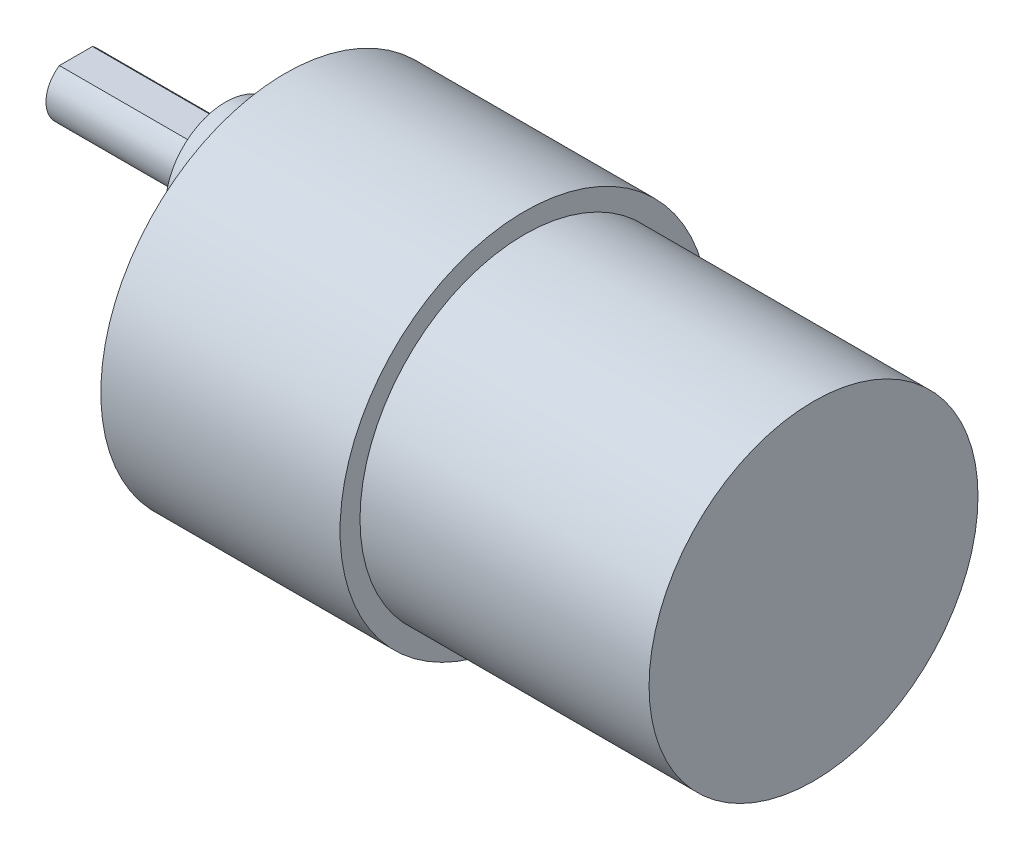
ISO-10303-21;
HEADER;
FILE_DESCRIPTION(('STEP AP214'),'2;1');
FILE_NAME('part.step','',(''),(''),'','','');
FILE_SCHEMA(('AUTOMOTIVE_DESIGN { 1 0 10303 214 1 1 1 1 }'));
ENDSEC;
DATA;
#1=APPLICATION_CONTEXT('core data for automotive mechanical design processes');
#2=APPLICATION_PROTOCOL_DEFINITION('international standard','automotive_design',2000,#1);
#3=PRODUCT_CONTEXT('',#1,'mechanical');
#4=PRODUCT('Part','Part','',(#3));
#5=PRODUCT_RELATED_PRODUCT_CATEGORY('part','',(#4));
#6=PRODUCT_DEFINITION_FORMATION('','',#4);
#7=PRODUCT_DEFINITION_CONTEXT('part definition',#1,'design');
#8=PRODUCT_DEFINITION('design','',#6,#7);
#9=PRODUCT_DEFINITION_SHAPE('','',#8);
#10=(LENGTH_UNIT() NAMED_UNIT(*) SI_UNIT(.MILLI.,.METRE.));
#11=(NAMED_UNIT(*) PLANE_ANGLE_UNIT() SI_UNIT($,.RADIAN.));
#12=(NAMED_UNIT(*) SI_UNIT($,.STERADIAN.) SOLID_ANGLE_UNIT());
#13=UNCERTAINTY_MEASURE_WITH_UNIT(LENGTH_MEASURE(1.E-05),#10,'distance_accuracy_value','');
#14=(GEOMETRIC_REPRESENTATION_CONTEXT(3) GLOBAL_UNCERTAINTY_ASSIGNED_CONTEXT((#13)) GLOBAL_UNIT_ASSIGNED_CONTEXT((#10,
#11,#12)) REPRESENTATION_CONTEXT('',''));
#15=CARTESIAN_POINT('',(0.,0.,0.));
#16=DIRECTION('',(0.,0.,1.));
#17=DIRECTION('',(1.,0.,0.));
#18=AXIS2_PLACEMENT_3D('',#15,#16,#17);
#19=CARTESIAN_POINT('',(-6.,7.,0.));
#20=DIRECTION('',(-1.,0.,0.));
#21=DIRECTION('',(0.,0.,1.));
#22=AXIS2_PLACEMENT_3D('',#19,#20,#21);
#23=PLANE('',#22);
#24=CARTESIAN_POINT('',(-6.,7.,0.));
#25=DIRECTION('',(-1.,0.,0.));
#26=DIRECTION('',(0.,0.,1.));
#27=AXIS2_PLACEMENT_3D('',#24,#25,#26);
#28=CIRCLE('',#27,6.);
#29=CARTESIAN_POINT('',(-6.,7.,6.));
#30=VERTEX_POINT('',#29);
#31=EDGE_CURVE('E146',#30,#30,#28,.T.);
#32=ORIENTED_EDGE('',*,*,#31,.T.);
#33=EDGE_LOOP('',(#32));
#34=FACE_BOUND('',#33,.T.);
#35=DIRECTION('',(0.,0.,-1.));
#36=VECTOR('',#35,1.);
#37=CARTESIAN_POINT('',(-6.,9.5,-1.6583123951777));
#38=LINE('',#37,#36);
#39=CARTESIAN_POINT('',(-6.,9.5,1.6583123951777));
#40=VERTEX_POINT('',#39);
#41=CARTESIAN_POINT('',(-6.,9.5,-1.6583123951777));
#42=VERTEX_POINT('',#41);
#43=EDGE_CURVE('E67',#40,#42,#38,.T.);
#44=ORIENTED_EDGE('',*,*,#43,.F.);
#45=CARTESIAN_POINT('',(-6.,7.,0.));
#46=DIRECTION('',(-1.,0.,0.));
#47=DIRECTION('',(0.,0.,1.));
#48=AXIS2_PLACEMENT_3D('',#45,#46,#47);
#49=CIRCLE('',#48,3.);
#50=EDGE_CURVE('E50',#42,#40,#49,.T.);
#51=ORIENTED_EDGE('',*,*,#50,.F.);
#52=EDGE_LOOP('',(#44,#51));
#53=FACE_BOUND('',#52,.T.);
#54=ADVANCED_FACE('F35',(#34,#53),#23,.T.);
#55=CARTESIAN_POINT('',(24.,0.,0.));
#56=DIRECTION('',(-1.,0.,0.));
#57=DIRECTION('',(0.,0.,1.));
#58=AXIS2_PLACEMENT_3D('',#55,#56,#57);
#59=CYLINDRICAL_SURFACE('',#58,18.5);
#60=CARTESIAN_POINT('',(24.,0.,0.));
#61=DIRECTION('',(1.,0.,0.));
#62=DIRECTION('',(0.,0.,-1.));
#63=AXIS2_PLACEMENT_3D('',#60,#61,#62);
#64=CIRCLE('',#63,18.5);
#65=CARTESIAN_POINT('',(24.,0.,-18.5));
#66=VERTEX_POINT('',#65);
#67=EDGE_CURVE('E43',#66,#66,#64,.T.);
#68=ORIENTED_EDGE('',*,*,#67,.F.);
#69=EDGE_LOOP('',(#68));
#70=FACE_BOUND('',#69,.T.);
#71=CARTESIAN_POINT('',(0.,0.,0.));
#72=DIRECTION('',(1.,0.,0.));
#73=DIRECTION('',(0.,0.,-1.));
#74=AXIS2_PLACEMENT_3D('',#71,#72,#73);
#75=CIRCLE('',#74,18.5);
#76=CARTESIAN_POINT('',(0.,0.,-18.5));
#77=VERTEX_POINT('',#76);
#78=EDGE_CURVE('E149',#77,#77,#75,.T.);
#79=ORIENTED_EDGE('',*,*,#78,.T.);
#80=EDGE_LOOP('',(#79));
#81=FACE_BOUND('',#80,.T.);
#82=ADVANCED_FACE('F37',(#70,#81),#59,.T.);
#83=CARTESIAN_POINT('',(24.,0.,0.));
#84=DIRECTION('',(1.,0.,0.));
#85=DIRECTION('',(0.,0.,-1.));
#86=AXIS2_PLACEMENT_3D('',#83,#84,#85);
#87=PLANE('',#86);
#88=CARTESIAN_POINT('',(24.,0.,0.));
#89=DIRECTION('',(1.,0.,0.));
#90=DIRECTION('',(0.,0.,-1.));
#91=AXIS2_PLACEMENT_3D('',#88,#89,#90);
#92=CIRCLE('',#91,16.5);
#93=CARTESIAN_POINT('',(24.,0.,16.5));
#94=VERTEX_POINT('',#93);
#95=EDGE_CURVE('E131',#94,#94,#92,.T.);
#96=ORIENTED_EDGE('',*,*,#95,.F.);
#97=EDGE_LOOP('',(#96));
#98=FACE_BOUND('',#97,.T.);
#99=ORIENTED_EDGE('',*,*,#67,.T.);
#100=EDGE_LOOP('',(#99));
#101=FACE_BOUND('',#100,.T.);
#102=ADVANCED_FACE('F158',(#98,#101),#87,.T.);
#103=CARTESIAN_POINT('',(0.,0.,0.));
#104=DIRECTION('',(1.,0.,0.));
#105=DIRECTION('',(0.,0.,-1.));
#106=AXIS2_PLACEMENT_3D('',#103,#104,#105);
#107=PLANE('',#106);
#108=CARTESIAN_POINT('',(0.,0.,-15.5));
#109=DIRECTION('',(-1.,0.,0.));
#110=DIRECTION('',(0.,0.,1.));
#111=AXIS2_PLACEMENT_3D('',#108,#109,#110);
#112=CIRCLE('',#111,1.5);
#113=CARTESIAN_POINT('',(0.,0.,-14.));
#114=VERTEX_POINT('',#113);
#115=EDGE_CURVE('E97',#114,#114,#112,.T.);
#116=ORIENTED_EDGE('',*,*,#115,.F.);
#117=EDGE_LOOP('',(#116));
#118=FACE_BOUND('',#117,.T.);
#119=CARTESIAN_POINT('',(0.,13.4233937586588,-7.74999999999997));
#120=DIRECTION('',(-1.,0.,0.));
#121=DIRECTION('',(0.,0.,1.));
#122=AXIS2_PLACEMENT_3D('',#119,#120,#121);
#123=CIRCLE('',#122,1.5);
#124=CARTESIAN_POINT('',(0.,13.4233937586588,-6.24999999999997));
#125=VERTEX_POINT('',#124);
#126=EDGE_CURVE('E96',#125,#125,#123,.T.);
#127=ORIENTED_EDGE('',*,*,#126,.F.);
#128=EDGE_LOOP('',(#127));
#129=FACE_BOUND('',#128,.T.);
#130=CARTESIAN_POINT('',(0.,13.4233937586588,7.75000000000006));
#131=DIRECTION('',(-1.,0.,0.));
#132=DIRECTION('',(0.,0.,1.));
#133=AXIS2_PLACEMENT_3D('',#130,#131,#132);
#134=CIRCLE('',#133,1.5);
#135=CARTESIAN_POINT('',(0.,13.4233937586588,9.25000000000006));
#136=VERTEX_POINT('',#135);
#137=EDGE_CURVE('E107',#136,#136,#134,.T.);
#138=ORIENTED_EDGE('',*,*,#137,.F.);
#139=EDGE_LOOP('',(#138));
#140=FACE_BOUND('',#139,.T.);
#141=CARTESIAN_POINT('',(0.,-1.08235921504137E-13,15.5));
#142=DIRECTION('',(-1.,0.,0.));
#143=DIRECTION('',(0.,0.,1.));
#144=AXIS2_PLACEMENT_3D('',#141,#142,#143);
#145=CIRCLE('',#144,1.5);
#146=CARTESIAN_POINT('',(0.,-1.08235921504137E-13,17.));
#147=VERTEX_POINT('',#146);
#148=EDGE_CURVE('E113',#147,#147,#145,.T.);
#149=ORIENTED_EDGE('',*,*,#148,.F.);
#150=EDGE_LOOP('',(#149));
#151=FACE_BOUND('',#150,.T.);
#152=CARTESIAN_POINT('',(0.,-13.4233937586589,7.74999999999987));
#153=DIRECTION('',(-1.,0.,0.));
#154=DIRECTION('',(0.,0.,1.));
#155=AXIS2_PLACEMENT_3D('',#152,#153,#154);
#156=CIRCLE('',#155,1.5);
#157=CARTESIAN_POINT('',(0.,-13.4233937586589,9.24999999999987));
#158=VERTEX_POINT('',#157);
#159=EDGE_CURVE('E119',#158,#158,#156,.T.);
#160=ORIENTED_EDGE('',*,*,#159,.F.);
#161=EDGE_LOOP('',(#160));
#162=FACE_BOUND('',#161,.T.);
#163=CARTESIAN_POINT('',(0.,-13.4233937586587,-7.75000000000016));
#164=DIRECTION('',(-1.,0.,0.));
#165=DIRECTION('',(0.,0.,1.));
#166=AXIS2_PLACEMENT_3D('',#163,#164,#165);
#167=CIRCLE('',#166,1.5);
#168=CARTESIAN_POINT('',(0.,-13.4233937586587,-6.25000000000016));
#169=VERTEX_POINT('',#168);
#170=EDGE_CURVE('E125',#169,#169,#167,.T.);
#171=ORIENTED_EDGE('',*,*,#170,.F.);
#172=EDGE_LOOP('',(#171));
#173=FACE_BOUND('',#172,.T.);
#174=CARTESIAN_POINT('',(0.,7.,0.));
#175=DIRECTION('',(1.,0.,0.));
#176=DIRECTION('',(0.,0.,-1.));
#177=AXIS2_PLACEMENT_3D('',#174,#175,#176);
#178=CIRCLE('',#177,6.);
#179=CARTESIAN_POINT('',(0.,7.,-6.));
#180=VERTEX_POINT('',#179);
#181=EDGE_CURVE('E11',#180,#180,#178,.F.);
#182=ORIENTED_EDGE('',*,*,#181,.F.);
#183=EDGE_LOOP('',(#182));
#184=FACE_BOUND('',#183,.T.);
#185=ORIENTED_EDGE('',*,*,#78,.F.);
#186=EDGE_LOOP('',(#185));
#187=FACE_BOUND('',#186,.T.);
#188=ADVANCED_FACE('F155',(#118,#129,#140,#151,#162,#173,#184,#187),#107,.F.);
#189=CARTESIAN_POINT('',(-6.,7.,0.));
#190=DIRECTION('',(1.,0.,0.));
#191=DIRECTION('',(0.,0.,-1.));
#192=AXIS2_PLACEMENT_3D('',#189,#190,#191);
#193=CYLINDRICAL_SURFACE('',#192,6.);
#194=ORIENTED_EDGE('',*,*,#31,.F.);
#195=EDGE_LOOP('',(#194));
#196=FACE_BOUND('',#195,.T.);
#197=ORIENTED_EDGE('',*,*,#181,.T.);
#198=EDGE_LOOP('',(#197));
#199=FACE_BOUND('',#198,.T.);
#200=ADVANCED_FACE('F157',(#196,#199),#193,.T.);
#201=CARTESIAN_POINT('',(-21.,7.,0.));
#202=DIRECTION('',(1.,0.,0.));
#203=DIRECTION('',(0.,0.,-1.));
#204=AXIS2_PLACEMENT_3D('',#201,#202,#203);
#205=CYLINDRICAL_SURFACE('',#204,3.);
#206=ORIENTED_EDGE('',*,*,#50,.T.);
#207=DIRECTION('',(1.,0.,0.));
#208=VECTOR('',#207,1.);
#209=CARTESIAN_POINT('',(-21.,9.5,1.6583123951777));
#210=LINE('',#209,#208);
#211=CARTESIAN_POINT('',(-21.,9.5,1.6583123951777));
#212=VERTEX_POINT('',#211);
#213=EDGE_CURVE('E144',#212,#40,#210,.T.);
#214=ORIENTED_EDGE('',*,*,#213,.F.);
#215=CARTESIAN_POINT('',(-21.,7.,0.));
#216=DIRECTION('',(-1.,0.,0.));
#217=DIRECTION('',(0.,0.,1.));
#218=AXIS2_PLACEMENT_3D('',#215,#216,#217);
#219=CIRCLE('',#218,3.);
#220=CARTESIAN_POINT('',(-21.,9.5,-1.6583123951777));
#221=VERTEX_POINT('',#220);
#222=EDGE_CURVE('E137',#221,#212,#219,.T.);
#223=ORIENTED_EDGE('',*,*,#222,.F.);
#224=DIRECTION('',(1.,0.,0.));
#225=VECTOR('',#224,1.);
#226=CARTESIAN_POINT('',(-21.,9.5,-1.6583123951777));
#227=LINE('',#226,#225);
#228=EDGE_CURVE('E140',#221,#42,#227,.T.);
#229=ORIENTED_EDGE('',*,*,#228,.T.);
#230=EDGE_LOOP('',(#206,#214,#223,#229));
#231=FACE_BOUND('',#230,.T.);
#232=ADVANCED_FACE('F164',(#231),#205,.T.);
#233=CARTESIAN_POINT('',(-21.,9.5,-1.6583123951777));
#234=DIRECTION('',(0.,-1.,0.));
#235=DIRECTION('',(0.,0.,-1.));
#236=AXIS2_PLACEMENT_3D('',#233,#234,#235);
#237=PLANE('',#236);
#238=ORIENTED_EDGE('',*,*,#43,.T.);
#239=ORIENTED_EDGE('',*,*,#228,.F.);
#240=DIRECTION('',(0.,0.,-1.));
#241=VECTOR('',#240,1.);
#242=CARTESIAN_POINT('',(-21.,9.5,-1.6583123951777));
#243=LINE('',#242,#241);
#244=EDGE_CURVE('E58',#212,#221,#243,.T.);
#245=ORIENTED_EDGE('',*,*,#244,.F.);
#246=ORIENTED_EDGE('',*,*,#213,.T.);
#247=EDGE_LOOP('',(#238,#239,#245,#246));
#248=FACE_BOUND('',#247,.T.);
#249=ADVANCED_FACE('F182',(#248),#237,.F.);
#250=CARTESIAN_POINT('',(-21.,7.,0.));
#251=DIRECTION('',(-1.,0.,0.));
#252=DIRECTION('',(0.,0.,1.));
#253=AXIS2_PLACEMENT_3D('',#250,#251,#252);
#254=PLANE('',#253);
#255=ORIENTED_EDGE('',*,*,#222,.T.);
#256=ORIENTED_EDGE('',*,*,#244,.T.);
#257=EDGE_LOOP('',(#255,#256));
#258=FACE_BOUND('',#257,.T.);
#259=ADVANCED_FACE('F185',(#258),#254,.T.);
#260=CARTESIAN_POINT('',(53.,0.,0.));
#261=DIRECTION('',(-1.,0.,0.));
#262=DIRECTION('',(0.,0.,1.));
#263=AXIS2_PLACEMENT_3D('',#260,#261,#262);
#264=CYLINDRICAL_SURFACE('',#263,16.5);
#265=CARTESIAN_POINT('',(53.,0.,0.));
#266=DIRECTION('',(1.,0.,0.));
#267=DIRECTION('',(0.,0.,-1.));
#268=AXIS2_PLACEMENT_3D('',#265,#266,#267);
#269=CIRCLE('',#268,16.5);
#270=CARTESIAN_POINT('',(53.,0.,16.5));
#271=VERTEX_POINT('',#270);
#272=EDGE_CURVE('E132',#271,#271,#269,.T.);
#273=CARTESIAN_POINT('',(53.,0.,16.5));
#274=CARTESIAN_POINT('',(52.6979166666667,0.,16.5));
#275=CARTESIAN_POINT('',(52.3958333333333,0.,16.5));
#276=CARTESIAN_POINT('',(51.7916666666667,0.,16.5));
#277=CARTESIAN_POINT('',(51.4895833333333,0.,16.5));
#278=CARTESIAN_POINT('',(50.8854166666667,0.,16.5));
#279=CARTESIAN_POINT('',(50.5833333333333,0.,16.5));
#280=CARTESIAN_POINT('',(49.9791666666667,0.,16.5));
#281=CARTESIAN_POINT('',(49.6770833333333,0.,16.5));
#282=CARTESIAN_POINT('',(49.0729166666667,0.,16.5));
#283=CARTESIAN_POINT('',(48.7708333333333,0.,16.5));
#284=CARTESIAN_POINT('',(48.1666666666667,0.,16.5));
#285=CARTESIAN_POINT('',(47.8645833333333,0.,16.5));
#286=CARTESIAN_POINT('',(47.2604166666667,0.,16.5));
#287=CARTESIAN_POINT('',(46.9583333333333,0.,16.5));
#288=CARTESIAN_POINT('',(46.3541666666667,0.,16.5));
#289=CARTESIAN_POINT('',(46.0520833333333,0.,16.5));
#290=CARTESIAN_POINT('',(45.4479166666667,0.,16.5));
#291=CARTESIAN_POINT('',(45.1458333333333,0.,16.5));
#292=CARTESIAN_POINT('',(44.5416666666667,0.,16.5));
#293=CARTESIAN_POINT('',(44.2395833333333,0.,16.5));
#294=CARTESIAN_POINT('',(43.6354166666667,0.,16.5));
#295=CARTESIAN_POINT('',(43.3333333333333,0.,16.5));
#296=CARTESIAN_POINT('',(42.7291666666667,0.,16.5));
#297=CARTESIAN_POINT('',(42.4270833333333,0.,16.5));
#298=CARTESIAN_POINT('',(41.8229166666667,0.,16.5));
#299=CARTESIAN_POINT('',(41.5208333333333,0.,16.5));
#300=CARTESIAN_POINT('',(40.9166666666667,0.,16.5));
#301=CARTESIAN_POINT('',(40.6145833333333,0.,16.5));
#302=CARTESIAN_POINT('',(40.0104166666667,0.,16.5));
#303=CARTESIAN_POINT('',(39.7083333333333,0.,16.5));
#304=CARTESIAN_POINT('',(39.1041666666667,0.,16.5));
#305=CARTESIAN_POINT('',(38.8020833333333,0.,16.5));
#306=CARTESIAN_POINT('',(38.1979166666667,0.,16.5));
#307=CARTESIAN_POINT('',(37.8958333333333,0.,16.5));
#308=CARTESIAN_POINT('',(37.2916666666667,0.,16.5));
#309=CARTESIAN_POINT('',(36.9895833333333,0.,16.5));
#310=CARTESIAN_POINT('',(36.3854166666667,0.,16.5));
#311=CARTESIAN_POINT('',(36.0833333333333,0.,16.5));
#312=CARTESIAN_POINT('',(35.4791666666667,0.,16.5));
#313=CARTESIAN_POINT('',(35.1770833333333,0.,16.5));
#314=CARTESIAN_POINT('',(34.5729166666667,0.,16.5));
#315=CARTESIAN_POINT('',(34.2708333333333,0.,16.5));
#316=CARTESIAN_POINT('',(33.6666666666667,0.,16.5));
#317=CARTESIAN_POINT('',(33.3645833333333,0.,16.5));
#318=CARTESIAN_POINT('',(32.7604166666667,0.,16.5));
#319=CARTESIAN_POINT('',(32.4583333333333,0.,16.5));
#320=CARTESIAN_POINT('',(31.8541666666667,0.,16.5));
#321=CARTESIAN_POINT('',(31.5520833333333,0.,16.5));
#322=CARTESIAN_POINT('',(30.9479166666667,0.,16.5));
#323=CARTESIAN_POINT('',(30.6458333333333,0.,16.5));
#324=CARTESIAN_POINT('',(30.0416666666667,0.,16.5));
#325=CARTESIAN_POINT('',(29.7395833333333,0.,16.5));
#326=CARTESIAN_POINT('',(29.1354166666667,0.,16.5));
#327=CARTESIAN_POINT('',(28.8333333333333,0.,16.5));
#328=CARTESIAN_POINT('',(28.2291666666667,0.,16.5));
#329=CARTESIAN_POINT('',(27.9270833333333,0.,16.5));
#330=CARTESIAN_POINT('',(27.3229166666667,0.,16.5));
#331=CARTESIAN_POINT('',(27.0208333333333,0.,16.5));
#332=CARTESIAN_POINT('',(26.4166666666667,0.,16.5));
#333=CARTESIAN_POINT('',(26.1145833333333,0.,16.5));
#334=CARTESIAN_POINT('',(25.5104166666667,0.,16.5));
#335=CARTESIAN_POINT('',(25.2083333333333,0.,16.5));
#336=CARTESIAN_POINT('',(24.6041666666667,0.,16.5));
#337=CARTESIAN_POINT('',(24.3020833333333,0.,16.5));
#338=CARTESIAN_POINT('',(24.,0.,16.5));
#339=B_SPLINE_CURVE_WITH_KNOTS('',3,(#273,#274,#275,#276,#277,#278,#279,#280,#281,#282,#283,
#284,#285,#286,#287,#288,#289,#290,#291,#292,#293,#294,#295,#296,#297,#298,#299,#300,#301,#302,
#303,#304,#305,#306,#307,#308,#309,#310,#311,#312,#313,#314,#315,#316,#317,#318,#319,#320,#321,
#322,#323,#324,#325,#326,#327,#328,#329,#330,#331,#332,#333,#334,#335,#336,#337,#338),
.UNSPECIFIED.,.F.,.F.,(4,2,2,2,2,2,2,2,2,2,2,2,2,2,2,2,2,2,2,2,2,2,2,2,2,2,2,2,2,2,2,2,4),(0.,
0.906250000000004,1.8125,2.71875000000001,3.625,4.53125,5.4375,6.34375,7.25000000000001,8.15625,
9.0625,9.96875000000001,10.875,11.78125,12.6875,13.59375,14.5,15.40625,16.3125,17.21875,18.125,
19.03125,19.9375,20.84375,21.75,22.65625,23.5625,24.46875,25.375,26.28125,27.1875,28.09375,29.),.UNSPECIFIED.);
#340=EDGE_CURVE('BSEAM188',#271,#94,#339,.T.);
#341=ORIENTED_EDGE('',*,*,#272,.F.);
#342=ORIENTED_EDGE('',*,*,#95,.T.);
#343=ORIENTED_EDGE('',*,*,#340,.T.);
#344=ORIENTED_EDGE('',*,*,#340,.F.);
#345=EDGE_LOOP('',(#341,#343,#342,#344));
#346=FACE_BOUND('',#345,.T.);
#347=ADVANCED_FACE('F188',(#346),#264,.T.);
#348=CARTESIAN_POINT('',(53.,0.,0.));
#349=DIRECTION('',(1.,0.,0.));
#350=DIRECTION('',(0.,0.,-1.));
#351=AXIS2_PLACEMENT_3D('',#348,#349,#350);
#352=PLANE('',#351);
#353=ORIENTED_EDGE('',*,*,#272,.T.);
#354=EDGE_LOOP('',(#353));
#355=FACE_BOUND('',#354,.T.);
#356=ADVANCED_FACE('F191',(#355),#352,.T.);
#357=CARTESIAN_POINT('',(9.05,-13.4233937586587,-7.75000000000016));
#358=DIRECTION('',(-1.,0.,0.));
#359=DIRECTION('',(0.,0.,1.));
#360=AXIS2_PLACEMENT_3D('',#357,#358,#359);
#361=CONICAL_SURFACE('',#360,1.5,1.02974425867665);
#362=CARTESIAN_POINT('',(9.95129092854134,-13.4233937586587,-7.75000000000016));
#363=VERTEX_POINT('',#362);
#364=VERTEX_LOOP('',#363);
#365=FACE_BOUND('',#364,.T.);
#366=CARTESIAN_POINT('',(9.05,-13.4233937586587,-7.75000000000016));
#367=DIRECTION('',(-1.,0.,0.));
#368=DIRECTION('',(0.,0.,1.));
#369=AXIS2_PLACEMENT_3D('',#366,#367,#368);
#370=CIRCLE('',#369,1.5);
#371=CARTESIAN_POINT('',(9.05,-13.4233937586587,-6.25000000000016));
#372=VERTEX_POINT('',#371);
#373=EDGE_CURVE('E128',#372,#372,#370,.T.);
#374=ORIENTED_EDGE('',*,*,#373,.T.);
#375=EDGE_LOOP('',(#374));
#376=FACE_BOUND('',#375,.T.);
#377=ADVANCED_FACE('F195',(#365,#376),#361,.F.);
#378=CARTESIAN_POINT('',(0.,-13.4233937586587,-7.75000000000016));
#379=DIRECTION('',(-1.,0.,0.));
#380=DIRECTION('',(0.,0.,1.));
#381=AXIS2_PLACEMENT_3D('',#378,#379,#380);
#382=CYLINDRICAL_SURFACE('',#381,1.5);
#383=ORIENTED_EDGE('',*,*,#373,.F.);
#384=EDGE_LOOP('',(#383));
#385=FACE_BOUND('',#384,.T.);
#386=ORIENTED_EDGE('',*,*,#170,.T.);
#387=EDGE_LOOP('',(#386));
#388=FACE_BOUND('',#387,.T.);
#389=ADVANCED_FACE('F199',(#385,#388),#382,.F.);
#390=CARTESIAN_POINT('',(9.05,-13.4233937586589,7.74999999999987));
#391=DIRECTION('',(-1.,0.,0.));
#392=DIRECTION('',(0.,0.,1.));
#393=AXIS2_PLACEMENT_3D('',#390,#391,#392);
#394=CONICAL_SURFACE('',#393,1.5,1.02974425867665);
#395=CARTESIAN_POINT('',(9.95129092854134,-13.4233937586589,7.74999999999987));
#396=VERTEX_POINT('',#395);
#397=VERTEX_LOOP('',#396);
#398=FACE_BOUND('',#397,.T.);
#399=CARTESIAN_POINT('',(9.05,-13.4233937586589,7.74999999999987));
#400=DIRECTION('',(-1.,0.,0.));
#401=DIRECTION('',(0.,0.,1.));
#402=AXIS2_PLACEMENT_3D('',#399,#400,#401);
#403=CIRCLE('',#402,1.5);
#404=CARTESIAN_POINT('',(9.05,-13.4233937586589,9.24999999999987));
#405=VERTEX_POINT('',#404);
#406=EDGE_CURVE('E122',#405,#405,#403,.T.);
#407=ORIENTED_EDGE('',*,*,#406,.T.);
#408=EDGE_LOOP('',(#407));
#409=FACE_BOUND('',#408,.T.);
#410=ADVANCED_FACE('F202',(#398,#409),#394,.F.);
#411=CARTESIAN_POINT('',(0.,-13.4233937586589,7.74999999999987));
#412=DIRECTION('',(-1.,0.,0.));
#413=DIRECTION('',(0.,0.,1.));
#414=AXIS2_PLACEMENT_3D('',#411,#412,#413);
#415=CYLINDRICAL_SURFACE('',#414,1.5);
#416=ORIENTED_EDGE('',*,*,#406,.F.);
#417=EDGE_LOOP('',(#416));
#418=FACE_BOUND('',#417,.T.);
#419=ORIENTED_EDGE('',*,*,#159,.T.);
#420=EDGE_LOOP('',(#419));
#421=FACE_BOUND('',#420,.T.);
#422=ADVANCED_FACE('F206',(#418,#421),#415,.F.);
#423=CARTESIAN_POINT('',(9.05,-1.08235921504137E-13,15.5));
#424=DIRECTION('',(-1.,0.,0.));
#425=DIRECTION('',(0.,0.,1.));
#426=AXIS2_PLACEMENT_3D('',#423,#424,#425);
#427=CONICAL_SURFACE('',#426,1.5,1.02974425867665);
#428=CARTESIAN_POINT('',(9.95129092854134,-1.10691105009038E-13,15.5));
#429=VERTEX_POINT('',#428);
#430=VERTEX_LOOP('',#429);
#431=FACE_BOUND('',#430,.T.);
#432=CARTESIAN_POINT('',(9.05,-1.08235921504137E-13,15.5));
#433=DIRECTION('',(-1.,0.,0.));
#434=DIRECTION('',(0.,0.,1.));
#435=AXIS2_PLACEMENT_3D('',#432,#433,#434);
#436=CIRCLE('',#435,1.5);
#437=CARTESIAN_POINT('',(9.05,-1.08235921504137E-13,17.));
#438=VERTEX_POINT('',#437);
#439=EDGE_CURVE('E116',#438,#438,#436,.T.);
#440=ORIENTED_EDGE('',*,*,#439,.T.);
#441=EDGE_LOOP('',(#440));
#442=FACE_BOUND('',#441,.T.);
#443=ADVANCED_FACE('F210',(#431,#442),#427,.F.);
#444=CARTESIAN_POINT('',(0.,-1.08235921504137E-13,15.5));
#445=DIRECTION('',(-1.,0.,0.));
#446=DIRECTION('',(0.,0.,1.));
#447=AXIS2_PLACEMENT_3D('',#444,#445,#446);
#448=CYLINDRICAL_SURFACE('',#447,1.5);
#449=ORIENTED_EDGE('',*,*,#439,.F.);
#450=EDGE_LOOP('',(#449));
#451=FACE_BOUND('',#450,.T.);
#452=ORIENTED_EDGE('',*,*,#148,.T.);
#453=EDGE_LOOP('',(#452));
#454=FACE_BOUND('',#453,.T.);
#455=ADVANCED_FACE('F214',(#451,#454),#448,.F.);
#456=CARTESIAN_POINT('',(9.05,13.4233937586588,7.75000000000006));
#457=DIRECTION('',(-1.,0.,0.));
#458=DIRECTION('',(0.,0.,1.));
#459=AXIS2_PLACEMENT_3D('',#456,#457,#458);
#460=CONICAL_SURFACE('',#459,1.5,1.02974425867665);
#461=CARTESIAN_POINT('',(9.95129092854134,13.4233937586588,7.75000000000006));
#462=VERTEX_POINT('',#461);
#463=VERTEX_LOOP('',#462);
#464=FACE_BOUND('',#463,.T.);
#465=CARTESIAN_POINT('',(9.05,13.4233937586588,7.75000000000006));
#466=DIRECTION('',(-1.,0.,0.));
#467=DIRECTION('',(0.,0.,1.));
#468=AXIS2_PLACEMENT_3D('',#465,#466,#467);
#469=CIRCLE('',#468,1.5);
#470=CARTESIAN_POINT('',(9.05,13.4233937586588,9.25000000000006));
#471=VERTEX_POINT('',#470);
#472=EDGE_CURVE('E110',#471,#471,#469,.T.);
#473=ORIENTED_EDGE('',*,*,#472,.T.);
#474=EDGE_LOOP('',(#473));
#475=FACE_BOUND('',#474,.T.);
#476=ADVANCED_FACE('F218',(#464,#475),#460,.F.);
#477=CARTESIAN_POINT('',(0.,13.4233937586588,7.75000000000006));
#478=DIRECTION('',(-1.,0.,0.));
#479=DIRECTION('',(0.,0.,1.));
#480=AXIS2_PLACEMENT_3D('',#477,#478,#479);
#481=CYLINDRICAL_SURFACE('',#480,1.5);
#482=ORIENTED_EDGE('',*,*,#472,.F.);
#483=EDGE_LOOP('',(#482));
#484=FACE_BOUND('',#483,.T.);
#485=ORIENTED_EDGE('',*,*,#137,.T.);
#486=EDGE_LOOP('',(#485));
#487=FACE_BOUND('',#486,.T.);
#488=ADVANCED_FACE('F222',(#484,#487),#481,.F.);
#489=CARTESIAN_POINT('',(9.05,13.4233937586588,-7.74999999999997));
#490=DIRECTION('',(-1.,0.,0.));
#491=DIRECTION('',(0.,0.,1.));
#492=AXIS2_PLACEMENT_3D('',#489,#490,#491);
#493=CONICAL_SURFACE('',#492,1.5,1.02974425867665);
#494=CARTESIAN_POINT('',(9.95129092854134,13.4233937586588,-7.74999999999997));
#495=VERTEX_POINT('',#494);
#496=VERTEX_LOOP('',#495);
#497=FACE_BOUND('',#496,.T.);
#498=CARTESIAN_POINT('',(9.05,13.4233937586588,-7.74999999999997));
#499=DIRECTION('',(-1.,0.,0.));
#500=DIRECTION('',(0.,0.,1.));
#501=AXIS2_PLACEMENT_3D('',#498,#499,#500);
#502=CIRCLE('',#501,1.5);
#503=CARTESIAN_POINT('',(9.05,13.4233937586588,-6.24999999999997));
#504=VERTEX_POINT('',#503);
#505=EDGE_CURVE('E100',#504,#504,#502,.T.);
#506=ORIENTED_EDGE('',*,*,#505,.T.);
#507=EDGE_LOOP('',(#506));
#508=FACE_BOUND('',#507,.T.);
#509=ADVANCED_FACE('F226',(#497,#508),#493,.F.);
#510=CARTESIAN_POINT('',(0.,13.4233937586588,-7.74999999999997));
#511=DIRECTION('',(-1.,0.,0.));
#512=DIRECTION('',(0.,0.,1.));
#513=AXIS2_PLACEMENT_3D('',#510,#511,#512);
#514=CYLINDRICAL_SURFACE('',#513,1.5);
#515=ORIENTED_EDGE('',*,*,#505,.F.);
#516=EDGE_LOOP('',(#515));
#517=FACE_BOUND('',#516,.T.);
#518=ORIENTED_EDGE('',*,*,#126,.T.);
#519=EDGE_LOOP('',(#518));
#520=FACE_BOUND('',#519,.T.);
#521=ADVANCED_FACE('F90',(#517,#520),#514,.F.);
#522=CARTESIAN_POINT('',(9.05,0.,-15.5));
#523=DIRECTION('',(-1.,0.,0.));
#524=DIRECTION('',(0.,0.,1.));
#525=AXIS2_PLACEMENT_3D('',#522,#523,#524);
#526=CONICAL_SURFACE('',#525,1.5,1.02974425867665);
#527=CARTESIAN_POINT('',(9.95129092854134,0.,-15.5));
#528=VERTEX_POINT('',#527);
#529=VERTEX_LOOP('',#528);
#530=FACE_BOUND('',#529,.T.);
#531=CARTESIAN_POINT('',(9.05,0.,-15.5));
#532=DIRECTION('',(-1.,0.,0.));
#533=DIRECTION('',(0.,0.,1.));
#534=AXIS2_PLACEMENT_3D('',#531,#532,#533);
#535=CIRCLE('',#534,1.5);
#536=CARTESIAN_POINT('',(9.05,0.,-14.));
#537=VERTEX_POINT('',#536);
#538=EDGE_CURVE('E94',#537,#537,#535,.T.);
#539=ORIENTED_EDGE('',*,*,#538,.T.);
#540=EDGE_LOOP('',(#539));
#541=FACE_BOUND('',#540,.T.);
#542=ADVANCED_FACE('F86',(#530,#541),#526,.F.);
#543=CARTESIAN_POINT('',(0.,0.,-15.5));
#544=DIRECTION('',(-1.,0.,0.));
#545=DIRECTION('',(0.,0.,1.));
#546=AXIS2_PLACEMENT_3D('',#543,#544,#545);
#547=CYLINDRICAL_SURFACE('',#546,1.5);
#548=ORIENTED_EDGE('',*,*,#538,.F.);
#549=EDGE_LOOP('',(#548));
#550=FACE_BOUND('',#549,.T.);
#551=ORIENTED_EDGE('',*,*,#115,.T.);
#552=EDGE_LOOP('',(#551));
#553=FACE_BOUND('',#552,.T.);
#554=ADVANCED_FACE('F89',(#550,#553),#547,.F.);
#555=CLOSED_SHELL('',(#54,#82,#102,#188,#200,#232,#249,#259,#347,#356,#377,#389,#410,#422,#443,
#455,#476,#488,#509,#521,#542,#554));
#556=MANIFOLD_SOLID_BREP('B2',#555);
#557=ADVANCED_BREP_SHAPE_REPRESENTATION('',(#18,#556),#14);
#558=SHAPE_DEFINITION_REPRESENTATION(#9,#557);
ENDSEC;
END-ISO-10303-21;
